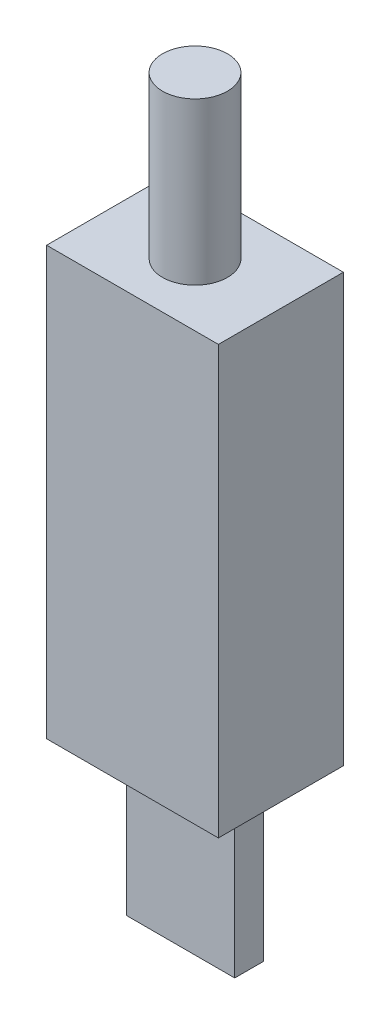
from build123d import *

# Parameters (mm, degrees)
SKETCH1_W           = 6.8072
SKETCH1_H           = 1.8034
BOSS_EXTRUDE1_DEPTH = 10.16
SKETCH2_W           = 10.8204
SKETCH2_H           = 7.874
BOSS_EXTRUDE2_DEPTH = 26.924
SKETCH3_R           = 2.0447
BOSS_EXTRUDE3_DEPTH = 10.16


with BuildPart() as part:
    # Sketch1 → Boss-Extrude1 (new body)
    with BuildSketch(Plane(origin=(0, 0, 0), x_dir=(1, 0, 0), z_dir=(0, 1, 0))):
        with Locations((3.4036, 0.9017)):
            Rectangle(SKETCH1_W, SKETCH1_H)
    extrude(amount=BOSS_EXTRUDE1_DEPTH)

    # Sketch2 → Boss-Extrude2 (add)
    with BuildSketch(Plane(origin=(0, 10.16, 0), x_dir=(1, 0, 0), z_dir=(0, 1, 0))):
        with Locations((3.4036, 0.9017)):
            Rectangle(SKETCH2_W, SKETCH2_H)
    extrude(amount=BOSS_EXTRUDE2_DEPTH)

    # Sketch3 → Boss-Extrude3 (add)
    with BuildSketch(Plane(origin=(0, 37.084, 0), x_dir=(1, 0, 0), z_dir=(0, 1, 0))):
        with Locations(Location((3.4036, 0.9017, 0), (0, 0, 90))):
            Circle(SKETCH3_R)
    extrude(amount=BOSS_EXTRUDE3_DEPTH)


solid = part.part
